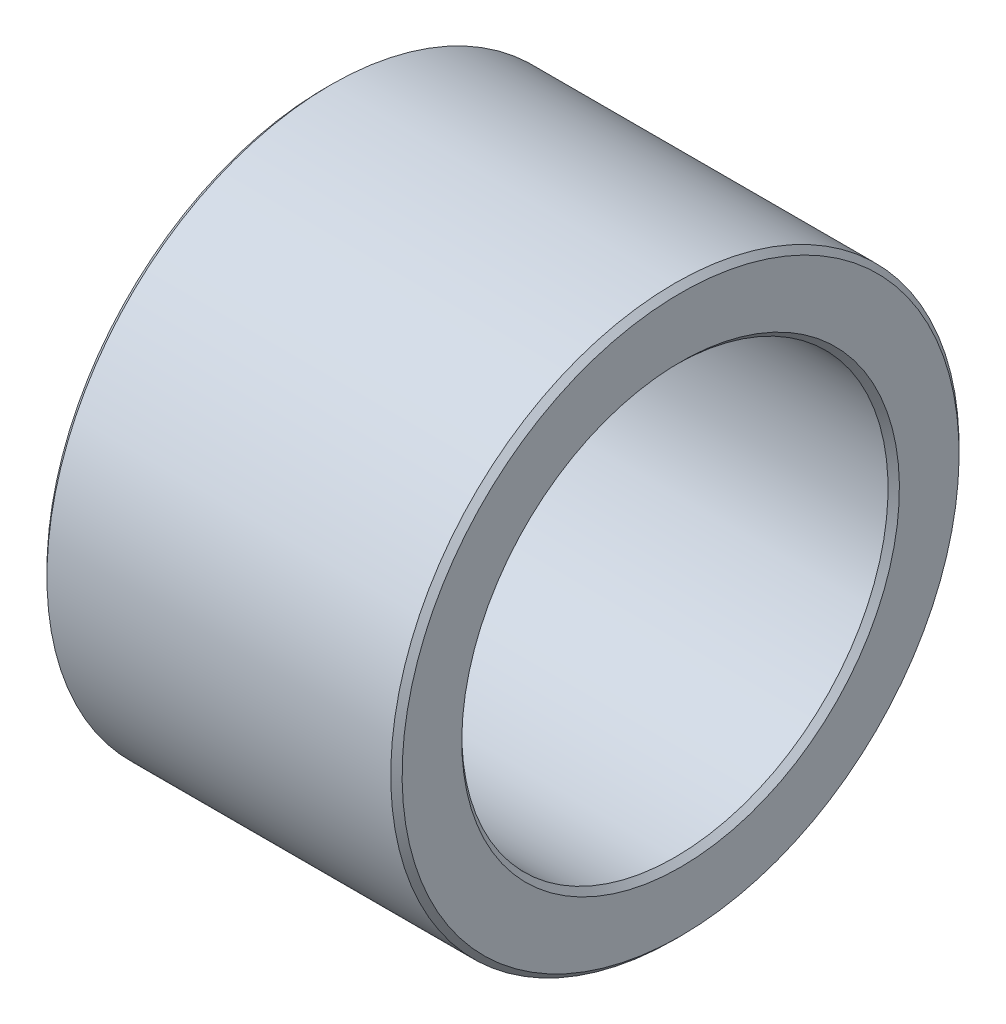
ISO-10303-21;
HEADER;
FILE_DESCRIPTION(('STEP AP214'),'2;1');
FILE_NAME('part.step','',(''),(''),'','','');
FILE_SCHEMA(('AUTOMOTIVE_DESIGN { 1 0 10303 214 1 1 1 1 }'));
ENDSEC;
DATA;
#1=APPLICATION_CONTEXT('core data for automotive mechanical design processes');
#2=APPLICATION_PROTOCOL_DEFINITION('international standard','automotive_design',2000,#1);
#3=PRODUCT_CONTEXT('',#1,'mechanical');
#4=PRODUCT('Part','Part','',(#3));
#5=PRODUCT_RELATED_PRODUCT_CATEGORY('part','',(#4));
#6=PRODUCT_DEFINITION_FORMATION('','',#4);
#7=PRODUCT_DEFINITION_CONTEXT('part definition',#1,'design');
#8=PRODUCT_DEFINITION('design','',#6,#7);
#9=PRODUCT_DEFINITION_SHAPE('','',#8);
#10=(LENGTH_UNIT() NAMED_UNIT(*) SI_UNIT(.MILLI.,.METRE.));
#11=(NAMED_UNIT(*) PLANE_ANGLE_UNIT() SI_UNIT($,.RADIAN.));
#12=(NAMED_UNIT(*) SI_UNIT($,.STERADIAN.) SOLID_ANGLE_UNIT());
#13=UNCERTAINTY_MEASURE_WITH_UNIT(LENGTH_MEASURE(1.E-05),#10,'distance_accuracy_value','');
#14=(GEOMETRIC_REPRESENTATION_CONTEXT(3) GLOBAL_UNCERTAINTY_ASSIGNED_CONTEXT((#13)) GLOBAL_UNIT_ASSIGNED_CONTEXT((#10,
#11,#12)) REPRESENTATION_CONTEXT('',''));
#15=CARTESIAN_POINT('',(0.,0.,0.));
#16=DIRECTION('',(0.,0.,1.));
#17=DIRECTION('',(1.,0.,0.));
#18=AXIS2_PLACEMENT_3D('',#15,#16,#17);
#19=CARTESIAN_POINT('',(0.,-17.5,0.));
#20=DIRECTION('',(-1.,0.,0.));
#21=DIRECTION('',(0.,1.,0.));
#22=AXIS2_PLACEMENT_3D('',#19,#20,#21);
#23=PLANE('',#22);
#24=CARTESIAN_POINT('',(0.,0.,0.));
#25=DIRECTION('',(1.,0.,0.));
#26=DIRECTION('',(0.,-1.,0.));
#27=AXIS2_PLACEMENT_3D('',#24,#25,#26);
#28=CIRCLE('',#27,15.4);
#29=CARTESIAN_POINT('',(0.,-15.4,0.));
#30=VERTEX_POINT('',#29);
#31=EDGE_CURVE('E9',#30,#30,#28,.T.);
#32=ORIENTED_EDGE('',*,*,#31,.T.);
#33=EDGE_LOOP('',(#32));
#34=FACE_BOUND('',#33,.T.);
#35=CARTESIAN_POINT('',(0.,0.,0.));
#36=DIRECTION('',(1.,0.,0.));
#37=DIRECTION('',(0.,-1.,0.));
#38=AXIS2_PLACEMENT_3D('',#35,#36,#37);
#39=CIRCLE('',#38,19.6);
#40=CARTESIAN_POINT('',(0.,-19.6,0.));
#41=VERTEX_POINT('',#40);
#42=EDGE_CURVE('E53',#41,#41,#39,.T.);
#43=ORIENTED_EDGE('',*,*,#42,.F.);
#44=EDGE_LOOP('',(#43));
#45=FACE_BOUND('',#44,.T.);
#46=ADVANCED_FACE('F15',(#34,#45),#23,.T.);
#47=CARTESIAN_POINT('',(0.2,0.,0.));
#48=DIRECTION('',(-1.,0.,0.));
#49=DIRECTION('',(0.,-1.,0.));
#50=AXIS2_PLACEMENT_3D('',#47,#48,#49);
#51=CONICAL_SURFACE('',#50,15.2,0.78539816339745);
#52=CARTESIAN_POINT('',(0.4,0.,0.));
#53=DIRECTION('',(1.,0.,0.));
#54=DIRECTION('',(0.,-1.,0.));
#55=AXIS2_PLACEMENT_3D('',#52,#53,#54);
#56=CIRCLE('',#55,15.);
#57=CARTESIAN_POINT('',(0.4,-15.,0.));
#58=VERTEX_POINT('',#57);
#59=EDGE_CURVE('E22',#58,#58,#56,.T.);
#60=ORIENTED_EDGE('',*,*,#59,.T.);
#61=EDGE_LOOP('',(#60));
#62=FACE_BOUND('',#61,.T.);
#63=ORIENTED_EDGE('',*,*,#31,.F.);
#64=EDGE_LOOP('',(#63));
#65=FACE_BOUND('',#64,.T.);
#66=ADVANCED_FACE('F82',(#62,#65),#51,.F.);
#67=CARTESIAN_POINT('',(12.5,0.,0.));
#68=DIRECTION('',(-1.,0.,0.));
#69=DIRECTION('',(0.,-1.,0.));
#70=AXIS2_PLACEMENT_3D('',#67,#68,#69);
#71=CYLINDRICAL_SURFACE('',#70,15.);
#72=CARTESIAN_POINT('',(24.6,0.,0.));
#73=DIRECTION('',(1.,0.,0.));
#74=DIRECTION('',(0.,-1.,0.));
#75=AXIS2_PLACEMENT_3D('',#72,#73,#74);
#76=CIRCLE('',#75,15.);
#77=CARTESIAN_POINT('',(24.6,-15.,0.));
#78=VERTEX_POINT('',#77);
#79=EDGE_CURVE('E58',#78,#78,#76,.T.);
#80=ORIENTED_EDGE('',*,*,#79,.T.);
#81=EDGE_LOOP('',(#80));
#82=FACE_BOUND('',#81,.T.);
#83=ORIENTED_EDGE('',*,*,#59,.F.);
#84=EDGE_LOOP('',(#83));
#85=FACE_BOUND('',#84,.T.);
#86=ADVANCED_FACE('F66',(#82,#85),#71,.F.);
#87=CARTESIAN_POINT('',(24.8,0.,0.));
#88=DIRECTION('',(1.,0.,0.));
#89=DIRECTION('',(0.,-1.,0.));
#90=AXIS2_PLACEMENT_3D('',#87,#88,#89);
#91=CONICAL_SURFACE('',#90,15.2,0.785398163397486);
#92=CARTESIAN_POINT('',(25.,0.,0.));
#93=DIRECTION('',(1.,0.,0.));
#94=DIRECTION('',(0.,-1.,0.));
#95=AXIS2_PLACEMENT_3D('',#92,#93,#94);
#96=CIRCLE('',#95,15.4);
#97=CARTESIAN_POINT('',(25.,-15.4,0.));
#98=VERTEX_POINT('',#97);
#99=EDGE_CURVE('E63',#98,#98,#96,.T.);
#100=ORIENTED_EDGE('',*,*,#99,.T.);
#101=EDGE_LOOP('',(#100));
#102=FACE_BOUND('',#101,.T.);
#103=ORIENTED_EDGE('',*,*,#79,.F.);
#104=EDGE_LOOP('',(#103));
#105=FACE_BOUND('',#104,.T.);
#106=ADVANCED_FACE('F69',(#102,#105),#91,.F.);
#107=CARTESIAN_POINT('',(25.,-17.5,0.));
#108=DIRECTION('',(1.,0.,0.));
#109=DIRECTION('',(0.,-1.,0.));
#110=AXIS2_PLACEMENT_3D('',#107,#108,#109);
#111=PLANE('',#110);
#112=CARTESIAN_POINT('',(25.,0.,0.));
#113=DIRECTION('',(1.,0.,0.));
#114=DIRECTION('',(0.,-1.,0.));
#115=AXIS2_PLACEMENT_3D('',#112,#113,#114);
#116=CIRCLE('',#115,19.6);
#117=CARTESIAN_POINT('',(25.,-19.6,0.));
#118=VERTEX_POINT('',#117);
#119=EDGE_CURVE('E61',#118,#118,#116,.T.);
#120=ORIENTED_EDGE('',*,*,#119,.T.);
#121=EDGE_LOOP('',(#120));
#122=FACE_BOUND('',#121,.T.);
#123=ORIENTED_EDGE('',*,*,#99,.F.);
#124=EDGE_LOOP('',(#123));
#125=FACE_BOUND('',#124,.T.);
#126=ADVANCED_FACE('F71',(#122,#125),#111,.T.);
#127=CARTESIAN_POINT('',(24.8,0.,0.));
#128=DIRECTION('',(-1.,0.,0.));
#129=DIRECTION('',(0.,-1.,0.));
#130=AXIS2_PLACEMENT_3D('',#127,#128,#129);
#131=CONICAL_SURFACE('',#130,19.8,0.785398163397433);
#132=CARTESIAN_POINT('',(24.6,0.,0.));
#133=DIRECTION('',(1.,0.,0.));
#134=DIRECTION('',(0.,-1.,0.));
#135=AXIS2_PLACEMENT_3D('',#132,#133,#134);
#136=CIRCLE('',#135,20.);
#137=CARTESIAN_POINT('',(24.6,-20.,0.));
#138=VERTEX_POINT('',#137);
#139=EDGE_CURVE('E55',#138,#138,#136,.T.);
#140=ORIENTED_EDGE('',*,*,#139,.T.);
#141=EDGE_LOOP('',(#140));
#142=FACE_BOUND('',#141,.T.);
#143=ORIENTED_EDGE('',*,*,#119,.F.);
#144=EDGE_LOOP('',(#143));
#145=FACE_BOUND('',#144,.T.);
#146=ADVANCED_FACE('F79',(#142,#145),#131,.T.);
#147=CARTESIAN_POINT('',(12.5,0.,0.));
#148=DIRECTION('',(-1.,0.,0.));
#149=DIRECTION('',(0.,-1.,0.));
#150=AXIS2_PLACEMENT_3D('',#147,#148,#149);
#151=CYLINDRICAL_SURFACE('',#150,20.);
#152=CARTESIAN_POINT('',(0.4,0.,0.));
#153=DIRECTION('',(1.,0.,0.));
#154=DIRECTION('',(0.,-1.,0.));
#155=AXIS2_PLACEMENT_3D('',#152,#153,#154);
#156=CIRCLE('',#155,20.);
#157=CARTESIAN_POINT('',(0.4,-20.,0.));
#158=VERTEX_POINT('',#157);
#159=EDGE_CURVE('E49',#158,#158,#156,.T.);
#160=ORIENTED_EDGE('',*,*,#159,.T.);
#161=EDGE_LOOP('',(#160));
#162=FACE_BOUND('',#161,.T.);
#163=ORIENTED_EDGE('',*,*,#139,.F.);
#164=EDGE_LOOP('',(#163));
#165=FACE_BOUND('',#164,.T.);
#166=ADVANCED_FACE('F50',(#162,#165),#151,.T.);
#167=CARTESIAN_POINT('',(0.2,0.,0.));
#168=DIRECTION('',(1.,0.,0.));
#169=DIRECTION('',(0.,-1.,0.));
#170=AXIS2_PLACEMENT_3D('',#167,#168,#169);
#171=CONICAL_SURFACE('',#170,19.8,0.78539816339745);
#172=ORIENTED_EDGE('',*,*,#42,.T.);
#173=EDGE_LOOP('',(#172));
#174=FACE_BOUND('',#173,.T.);
#175=ORIENTED_EDGE('',*,*,#159,.F.);
#176=EDGE_LOOP('',(#175));
#177=FACE_BOUND('',#176,.T.);
#178=ADVANCED_FACE('F92',(#174,#177),#171,.T.);
#179=CLOSED_SHELL('',(#46,#66,#86,#106,#126,#146,#166,#178));
#180=MANIFOLD_SOLID_BREP('B1',#179);
#181=ADVANCED_BREP_SHAPE_REPRESENTATION('',(#18,#180),#14);
#182=SHAPE_DEFINITION_REPRESENTATION(#9,#181);
ENDSEC;
END-ISO-10303-21;
